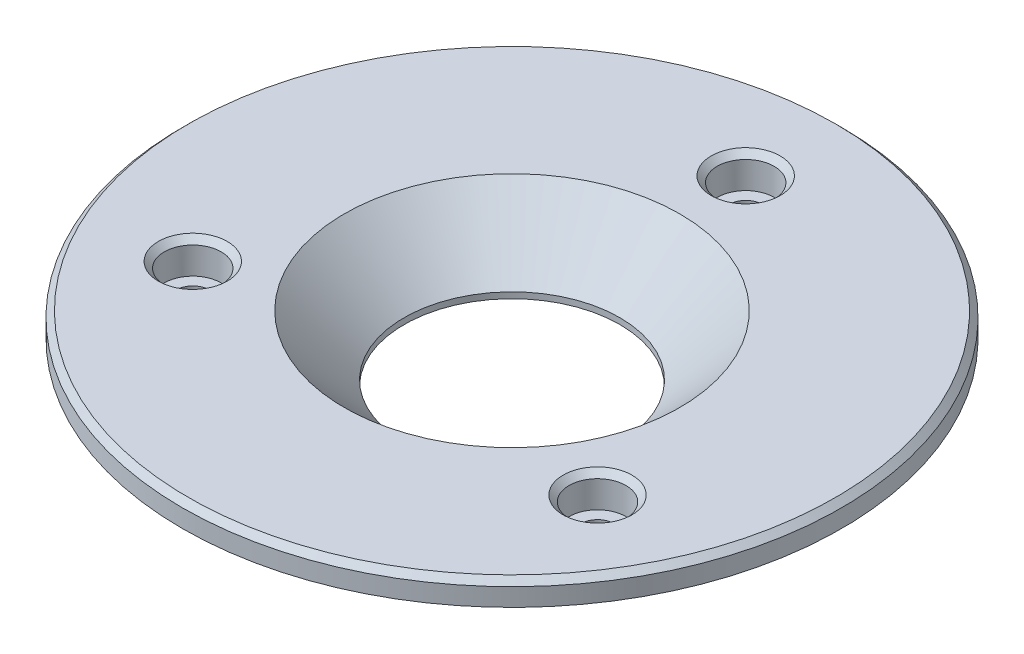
ISO-10303-21;
HEADER;
FILE_DESCRIPTION(('STEP AP214'),'2;1');
FILE_NAME('part.step','',(''),(''),'','','');
FILE_SCHEMA(('AUTOMOTIVE_DESIGN { 1 0 10303 214 1 1 1 1 }'));
ENDSEC;
DATA;
#1=APPLICATION_CONTEXT('core data for automotive mechanical design processes');
#2=APPLICATION_PROTOCOL_DEFINITION('international standard','automotive_design',2000,#1);
#3=PRODUCT_CONTEXT('',#1,'mechanical');
#4=PRODUCT('Part','Part','',(#3));
#5=PRODUCT_RELATED_PRODUCT_CATEGORY('part','',(#4));
#6=PRODUCT_DEFINITION_FORMATION('','',#4);
#7=PRODUCT_DEFINITION_CONTEXT('part definition',#1,'design');
#8=PRODUCT_DEFINITION('design','',#6,#7);
#9=PRODUCT_DEFINITION_SHAPE('','',#8);
#10=(LENGTH_UNIT() NAMED_UNIT(*) SI_UNIT(.MILLI.,.METRE.));
#11=(NAMED_UNIT(*) PLANE_ANGLE_UNIT() SI_UNIT($,.RADIAN.));
#12=(NAMED_UNIT(*) SI_UNIT($,.STERADIAN.) SOLID_ANGLE_UNIT());
#13=UNCERTAINTY_MEASURE_WITH_UNIT(LENGTH_MEASURE(1.E-05),#10,'distance_accuracy_value','');
#14=(GEOMETRIC_REPRESENTATION_CONTEXT(3) GLOBAL_UNCERTAINTY_ASSIGNED_CONTEXT((#13)) GLOBAL_UNIT_ASSIGNED_CONTEXT((#10,
#11,#12)) REPRESENTATION_CONTEXT('',''));
#15=CARTESIAN_POINT('',(0.,0.,0.));
#16=DIRECTION('',(0.,0.,1.));
#17=DIRECTION('',(1.,0.,0.));
#18=AXIS2_PLACEMENT_3D('',#15,#16,#17);
#19=CARTESIAN_POINT('',(-28.,11.,0.));
#20=DIRECTION('',(0.,-1.,0.));
#21=DIRECTION('',(0.,0.,-1.));
#22=AXIS2_PLACEMENT_3D('',#19,#20,#21);
#23=PLANE('',#22);
#24=CARTESIAN_POINT('',(33.7749907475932,11.,19.5));
#25=DIRECTION('',(0.,-1.,0.));
#26=DIRECTION('',(0.,0.,-1.));
#27=AXIS2_PLACEMENT_3D('',#24,#25,#26);
#28=CIRCLE('',#27,5.75);
#29=CARTESIAN_POINT('',(33.7749907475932,11.,13.75));
#30=VERTEX_POINT('',#29);
#31=EDGE_CURVE('E25',#30,#30,#28,.T.);
#32=ORIENTED_EDGE('',*,*,#31,.T.);
#33=EDGE_LOOP('',(#32));
#34=FACE_BOUND('',#33,.T.);
#35=CARTESIAN_POINT('',(0.,11.,-39.));
#36=DIRECTION('',(0.,-1.,0.));
#37=DIRECTION('',(0.,0.,-1.));
#38=AXIS2_PLACEMENT_3D('',#35,#36,#37);
#39=CIRCLE('',#38,5.75);
#40=CARTESIAN_POINT('',(0.,11.,-44.75));
#41=VERTEX_POINT('',#40);
#42=EDGE_CURVE('E29',#41,#41,#39,.T.);
#43=ORIENTED_EDGE('',*,*,#42,.T.);
#44=EDGE_LOOP('',(#43));
#45=FACE_BOUND('',#44,.T.);
#46=CARTESIAN_POINT('',(-33.7749907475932,11.,19.5));
#47=DIRECTION('',(0.,-1.,0.));
#48=DIRECTION('',(0.,0.,-1.));
#49=AXIS2_PLACEMENT_3D('',#46,#47,#48);
#50=CIRCLE('',#49,5.75);
#51=CARTESIAN_POINT('',(-33.7749907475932,11.,13.75));
#52=VERTEX_POINT('',#51);
#53=EDGE_CURVE('E34',#52,#52,#50,.T.);
#54=ORIENTED_EDGE('',*,*,#53,.T.);
#55=EDGE_LOOP('',(#54));
#56=FACE_BOUND('',#55,.T.);
#57=CARTESIAN_POINT('',(0.,11.,0.));
#58=DIRECTION('',(0.,-1.,0.));
#59=DIRECTION('',(0.,0.,-1.));
#60=AXIS2_PLACEMENT_3D('',#57,#58,#59);
#61=CIRCLE('',#60,54.);
#62=CARTESIAN_POINT('',(0.,11.,-54.));
#63=VERTEX_POINT('',#62);
#64=EDGE_CURVE('E58',#63,#63,#61,.F.);
#65=ORIENTED_EDGE('',*,*,#64,.T.);
#66=EDGE_LOOP('',(#65));
#67=FACE_BOUND('',#66,.T.);
#68=CARTESIAN_POINT('',(0.,11.,0.));
#69=DIRECTION('',(0.,-1.,0.));
#70=DIRECTION('',(0.,0.,-1.));
#71=AXIS2_PLACEMENT_3D('',#68,#69,#70);
#72=CIRCLE('',#71,28.);
#73=CARTESIAN_POINT('',(0.,11.,-28.));
#74=VERTEX_POINT('',#73);
#75=EDGE_CURVE('E70',#74,#74,#72,.T.);
#76=ORIENTED_EDGE('',*,*,#75,.T.);
#77=EDGE_LOOP('',(#76));
#78=FACE_BOUND('',#77,.T.);
#79=ADVANCED_FACE('F14',(#34,#45,#56,#67,#78),#23,.F.);
#80=CARTESIAN_POINT('',(0.,1.,0.));
#81=DIRECTION('',(0.,1.,0.));
#82=DIRECTION('',(0.,0.,1.));
#83=AXIS2_PLACEMENT_3D('',#80,#81,#82);
#84=CONICAL_SURFACE('',#83,18.,0.78539816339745);
#85=ORIENTED_EDGE('',*,*,#75,.F.);
#86=EDGE_LOOP('',(#85));
#87=FACE_BOUND('',#86,.T.);
#88=CARTESIAN_POINT('',(0.,1.,0.));
#89=DIRECTION('',(0.,-1.,0.));
#90=DIRECTION('',(0.,0.,-1.));
#91=AXIS2_PLACEMENT_3D('',#88,#89,#90);
#92=CIRCLE('',#91,18.);
#93=CARTESIAN_POINT('',(0.,1.,-18.));
#94=VERTEX_POINT('',#93);
#95=EDGE_CURVE('E83',#94,#94,#92,.T.);
#96=ORIENTED_EDGE('',*,*,#95,.T.);
#97=EDGE_LOOP('',(#96));
#98=FACE_BOUND('',#97,.T.);
#99=ADVANCED_FACE('F123',(#87,#98),#84,.F.);
#100=CARTESIAN_POINT('',(0.,0.,0.));
#101=DIRECTION('',(0.,-1.,0.));
#102=DIRECTION('',(0.,0.,-1.));
#103=AXIS2_PLACEMENT_3D('',#100,#101,#102);
#104=CYLINDRICAL_SURFACE('',#103,18.);
#105=ORIENTED_EDGE('',*,*,#95,.F.);
#106=EDGE_LOOP('',(#105));
#107=FACE_BOUND('',#106,.T.);
#108=CARTESIAN_POINT('',(0.,0.,0.));
#109=DIRECTION('',(0.,-1.,0.));
#110=DIRECTION('',(0.,0.,-1.));
#111=AXIS2_PLACEMENT_3D('',#108,#109,#110);
#112=CIRCLE('',#111,18.);
#113=CARTESIAN_POINT('',(0.,0.,-18.));
#114=VERTEX_POINT('',#113);
#115=EDGE_CURVE('E86',#114,#114,#112,.T.);
#116=ORIENTED_EDGE('',*,*,#115,.T.);
#117=EDGE_LOOP('',(#116));
#118=FACE_BOUND('',#117,.T.);
#119=ADVANCED_FACE('F130',(#107,#118),#104,.F.);
#120=CARTESIAN_POINT('',(-18.,0.,0.));
#121=DIRECTION('',(0.,1.,0.));
#122=DIRECTION('',(0.,0.,1.));
#123=AXIS2_PLACEMENT_3D('',#120,#121,#122);
#124=PLANE('',#123);
#125=CARTESIAN_POINT('',(-33.7749907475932,0.,19.5));
#126=DIRECTION('',(0.,1.,0.));
#127=DIRECTION('',(0.,0.,1.));
#128=AXIS2_PLACEMENT_3D('',#125,#126,#127);
#129=CIRCLE('',#128,3.75);
#130=CARTESIAN_POINT('',(-33.7749907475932,0.,23.25));
#131=VERTEX_POINT('',#130);
#132=EDGE_CURVE('E49',#131,#131,#129,.T.);
#133=ORIENTED_EDGE('',*,*,#132,.T.);
#134=EDGE_LOOP('',(#133));
#135=FACE_BOUND('',#134,.T.);
#136=CARTESIAN_POINT('',(33.7749907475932,0.,19.5));
#137=DIRECTION('',(0.,1.,0.));
#138=DIRECTION('',(0.,0.,1.));
#139=AXIS2_PLACEMENT_3D('',#136,#137,#138);
#140=CIRCLE('',#139,3.75);
#141=CARTESIAN_POINT('',(33.7749907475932,0.,23.25));
#142=VERTEX_POINT('',#141);
#143=EDGE_CURVE('E52',#142,#142,#140,.T.);
#144=ORIENTED_EDGE('',*,*,#143,.T.);
#145=EDGE_LOOP('',(#144));
#146=FACE_BOUND('',#145,.T.);
#147=CARTESIAN_POINT('',(0.,0.,-39.));
#148=DIRECTION('',(0.,1.,0.));
#149=DIRECTION('',(0.,0.,1.));
#150=AXIS2_PLACEMENT_3D('',#147,#148,#149);
#151=CIRCLE('',#150,3.75);
#152=CARTESIAN_POINT('',(0.,0.,-35.25));
#153=VERTEX_POINT('',#152);
#154=EDGE_CURVE('E55',#153,#153,#151,.T.);
#155=ORIENTED_EDGE('',*,*,#154,.T.);
#156=EDGE_LOOP('',(#155));
#157=FACE_BOUND('',#156,.T.);
#158=CARTESIAN_POINT('',(0.,0.,0.));
#159=DIRECTION('',(0.,1.,0.));
#160=DIRECTION('',(0.,0.,1.));
#161=AXIS2_PLACEMENT_3D('',#158,#159,#160);
#162=CIRCLE('',#161,44.);
#163=CARTESIAN_POINT('',(0.,0.,44.));
#164=VERTEX_POINT('',#163);
#165=EDGE_CURVE('E67',#164,#164,#162,.F.);
#166=ORIENTED_EDGE('',*,*,#165,.T.);
#167=EDGE_LOOP('',(#166));
#168=FACE_BOUND('',#167,.T.);
#169=ORIENTED_EDGE('',*,*,#115,.F.);
#170=EDGE_LOOP('',(#169));
#171=FACE_BOUND('',#170,.T.);
#172=ADVANCED_FACE('F181',(#135,#146,#157,#168,#171),#124,.F.);
#173=CARTESIAN_POINT('',(0.,0.,0.));
#174=DIRECTION('',(0.,-1.,0.));
#175=DIRECTION('',(0.,0.,-1.));
#176=AXIS2_PLACEMENT_3D('',#173,#174,#175);
#177=CYLINDRICAL_SURFACE('',#176,45.);
#178=CARTESIAN_POINT('',(0.,1.00000000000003,0.));
#179=DIRECTION('',(0.,1.,0.));
#180=DIRECTION('',(0.,0.,1.));
#181=AXIS2_PLACEMENT_3D('',#178,#179,#180);
#182=CIRCLE('',#181,45.);
#183=CARTESIAN_POINT('',(0.,1.00000000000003,45.));
#184=VERTEX_POINT('',#183);
#185=EDGE_CURVE('E64',#184,#184,#182,.T.);
#186=ORIENTED_EDGE('',*,*,#185,.T.);
#187=EDGE_LOOP('',(#186));
#188=FACE_BOUND('',#187,.T.);
#189=CARTESIAN_POINT('',(0.,7.,0.));
#190=DIRECTION('',(0.,-1.,0.));
#191=DIRECTION('',(0.,0.,-1.));
#192=AXIS2_PLACEMENT_3D('',#189,#190,#191);
#193=CIRCLE('',#192,45.);
#194=CARTESIAN_POINT('',(0.,7.,-45.));
#195=VERTEX_POINT('',#194);
#196=EDGE_CURVE('E89',#195,#195,#193,.T.);
#197=ORIENTED_EDGE('',*,*,#196,.T.);
#198=EDGE_LOOP('',(#197));
#199=FACE_BOUND('',#198,.T.);
#200=ADVANCED_FACE('F185',(#188,#199),#177,.T.);
#201=CARTESIAN_POINT('',(-45.,7.,0.));
#202=DIRECTION('',(0.,1.,0.));
#203=DIRECTION('',(0.,0.,1.));
#204=AXIS2_PLACEMENT_3D('',#201,#202,#203);
#205=PLANE('',#204);
#206=ORIENTED_EDGE('',*,*,#196,.F.);
#207=EDGE_LOOP('',(#206));
#208=FACE_BOUND('',#207,.T.);
#209=CARTESIAN_POINT('',(0.,7.,0.));
#210=DIRECTION('',(0.,-1.,0.));
#211=DIRECTION('',(0.,0.,-1.));
#212=AXIS2_PLACEMENT_3D('',#209,#210,#211);
#213=CIRCLE('',#212,55.);
#214=CARTESIAN_POINT('',(0.,7.,-55.));
#215=VERTEX_POINT('',#214);
#216=EDGE_CURVE('E92',#215,#215,#213,.T.);
#217=ORIENTED_EDGE('',*,*,#216,.T.);
#218=EDGE_LOOP('',(#217));
#219=FACE_BOUND('',#218,.T.);
#220=ADVANCED_FACE('F192',(#208,#219),#205,.F.);
#221=CARTESIAN_POINT('',(0.,0.,0.));
#222=DIRECTION('',(0.,-1.,0.));
#223=DIRECTION('',(0.,0.,-1.));
#224=AXIS2_PLACEMENT_3D('',#221,#222,#223);
#225=CYLINDRICAL_SURFACE('',#224,55.);
#226=CARTESIAN_POINT('',(0.,10.,0.));
#227=DIRECTION('',(0.,-1.,0.));
#228=DIRECTION('',(0.,0.,-1.));
#229=AXIS2_PLACEMENT_3D('',#226,#227,#228);
#230=CIRCLE('',#229,55.);
#231=CARTESIAN_POINT('',(0.,10.,-55.));
#232=VERTEX_POINT('',#231);
#233=EDGE_CURVE('E61',#232,#232,#230,.T.);
#234=ORIENTED_EDGE('',*,*,#233,.T.);
#235=EDGE_LOOP('',(#234));
#236=FACE_BOUND('',#235,.T.);
#237=ORIENTED_EDGE('',*,*,#216,.F.);
#238=EDGE_LOOP('',(#237));
#239=FACE_BOUND('',#238,.T.);
#240=ADVANCED_FACE('F199',(#236,#239),#225,.T.);
#241=CARTESIAN_POINT('',(33.7749907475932,5.5,19.5));
#242=DIRECTION('',(0.,1.,0.));
#243=DIRECTION('',(0.,0.,1.));
#244=AXIS2_PLACEMENT_3D('',#241,#242,#243);
#245=CYLINDRICAL_SURFACE('',#244,4.75);
#246=CARTESIAN_POINT('',(33.7749907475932,10.,19.5));
#247=DIRECTION('',(0.,-1.,0.));
#248=DIRECTION('',(0.,0.,-1.));
#249=AXIS2_PLACEMENT_3D('',#246,#247,#248);
#250=CIRCLE('',#249,4.75);
#251=CARTESIAN_POINT('',(33.7749907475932,10.,14.75));
#252=VERTEX_POINT('',#251);
#253=EDGE_CURVE('E37',#252,#252,#250,.F.);
#254=ORIENTED_EDGE('',*,*,#253,.T.);
#255=EDGE_LOOP('',(#254));
#256=FACE_BOUND('',#255,.T.);
#257=CARTESIAN_POINT('',(33.7749907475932,5.5,19.5));
#258=DIRECTION('',(0.,1.,0.));
#259=DIRECTION('',(0.,0.,-1.));
#260=AXIS2_PLACEMENT_3D('',#257,#258,#259);
#261=CIRCLE('',#260,4.75);
#262=CARTESIAN_POINT('',(33.7749907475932,5.5,14.75));
#263=VERTEX_POINT('',#262);
#264=EDGE_CURVE('E74',#263,#263,#261,.T.);
#265=ORIENTED_EDGE('',*,*,#264,.F.);
#266=EDGE_LOOP('',(#265));
#267=FACE_BOUND('',#266,.T.);
#268=ADVANCED_FACE('F203',(#256,#267),#245,.F.);
#269=CARTESIAN_POINT('',(33.7749907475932,5.5,19.5));
#270=DIRECTION('',(0.,-1.,0.));
#271=DIRECTION('',(0.,0.,-1.));
#272=AXIS2_PLACEMENT_3D('',#269,#270,#271);
#273=PLANE('',#272);
#274=CARTESIAN_POINT('',(33.7749907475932,5.5,19.5));
#275=DIRECTION('',(0.,-1.,0.));
#276=DIRECTION('',(0.,0.,-1.));
#277=AXIS2_PLACEMENT_3D('',#274,#275,#276);
#278=CIRCLE('',#277,2.75);
#279=CARTESIAN_POINT('',(33.7749907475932,5.5,16.75));
#280=VERTEX_POINT('',#279);
#281=EDGE_CURVE('E71',#280,#280,#278,.T.);
#282=ORIENTED_EDGE('',*,*,#281,.T.);
#283=EDGE_LOOP('',(#282));
#284=FACE_BOUND('',#283,.T.);
#285=ORIENTED_EDGE('',*,*,#264,.T.);
#286=EDGE_LOOP('',(#285));
#287=FACE_BOUND('',#286,.T.);
#288=ADVANCED_FACE('F207',(#284,#287),#273,.F.);
#289=CARTESIAN_POINT('',(-33.7749907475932,5.5,19.5));
#290=DIRECTION('',(0.,1.,0.));
#291=DIRECTION('',(0.,0.,1.));
#292=AXIS2_PLACEMENT_3D('',#289,#290,#291);
#293=CYLINDRICAL_SURFACE('',#292,4.75);
#294=CARTESIAN_POINT('',(-33.7749907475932,10.,19.5));
#295=DIRECTION('',(0.,-1.,0.));
#296=DIRECTION('',(0.,0.,-1.));
#297=AXIS2_PLACEMENT_3D('',#294,#295,#296);
#298=CIRCLE('',#297,4.75);
#299=CARTESIAN_POINT('',(-33.7749907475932,10.,14.75));
#300=VERTEX_POINT('',#299);
#301=EDGE_CURVE('E9',#300,#300,#298,.F.);
#302=ORIENTED_EDGE('',*,*,#301,.T.);
#303=EDGE_LOOP('',(#302));
#304=FACE_BOUND('',#303,.T.);
#305=CARTESIAN_POINT('',(-33.7749907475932,5.5,19.5));
#306=DIRECTION('',(0.,1.,0.));
#307=DIRECTION('',(0.,0.,1.));
#308=AXIS2_PLACEMENT_3D('',#305,#306,#307);
#309=CIRCLE('',#308,4.75);
#310=CARTESIAN_POINT('',(-33.7749907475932,5.5,24.25));
#311=VERTEX_POINT('',#310);
#312=EDGE_CURVE('E98',#311,#311,#309,.T.);
#313=ORIENTED_EDGE('',*,*,#312,.F.);
#314=EDGE_LOOP('',(#313));
#315=FACE_BOUND('',#314,.T.);
#316=ADVANCED_FACE('F119',(#304,#315),#293,.F.);
#317=CARTESIAN_POINT('',(-33.7749907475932,5.5,19.5));
#318=DIRECTION('',(0.,1.,0.));
#319=DIRECTION('',(0.,0.,1.));
#320=AXIS2_PLACEMENT_3D('',#317,#318,#319);
#321=PLANE('',#320);
#322=CARTESIAN_POINT('',(-33.7749907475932,5.5,19.5));
#323=DIRECTION('',(0.,1.,0.));
#324=DIRECTION('',(0.,0.,1.));
#325=AXIS2_PLACEMENT_3D('',#322,#323,#324);
#326=CIRCLE('',#325,2.75);
#327=CARTESIAN_POINT('',(-33.7749907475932,5.5,22.25));
#328=VERTEX_POINT('',#327);
#329=EDGE_CURVE('E75',#328,#328,#326,.T.);
#330=ORIENTED_EDGE('',*,*,#329,.F.);
#331=EDGE_LOOP('',(#330));
#332=FACE_BOUND('',#331,.T.);
#333=ORIENTED_EDGE('',*,*,#312,.T.);
#334=EDGE_LOOP('',(#333));
#335=FACE_BOUND('',#334,.T.);
#336=ADVANCED_FACE('F108',(#332,#335),#321,.T.);
#337=CARTESIAN_POINT('',(0.,5.5,-39.));
#338=DIRECTION('',(0.,1.,0.));
#339=DIRECTION('',(0.,0.,1.));
#340=AXIS2_PLACEMENT_3D('',#337,#338,#339);
#341=CYLINDRICAL_SURFACE('',#340,4.75);
#342=CARTESIAN_POINT('',(0.,10.,-39.));
#343=DIRECTION('',(0.,-1.,0.));
#344=DIRECTION('',(0.,0.,-1.));
#345=AXIS2_PLACEMENT_3D('',#342,#343,#344);
#346=CIRCLE('',#345,4.75);
#347=CARTESIAN_POINT('',(0.,10.,-43.75));
#348=VERTEX_POINT('',#347);
#349=EDGE_CURVE('E21',#348,#348,#346,.F.);
#350=ORIENTED_EDGE('',*,*,#349,.T.);
#351=EDGE_LOOP('',(#350));
#352=FACE_BOUND('',#351,.T.);
#353=CARTESIAN_POINT('',(0.,5.5,-39.));
#354=DIRECTION('',(0.,1.,0.));
#355=DIRECTION('',(0.,0.,1.));
#356=AXIS2_PLACEMENT_3D('',#353,#354,#355);
#357=CIRCLE('',#356,4.75);
#358=CARTESIAN_POINT('',(0.,5.5,-34.25));
#359=VERTEX_POINT('',#358);
#360=EDGE_CURVE('E95',#359,#359,#357,.T.);
#361=ORIENTED_EDGE('',*,*,#360,.F.);
#362=EDGE_LOOP('',(#361));
#363=FACE_BOUND('',#362,.T.);
#364=ADVANCED_FACE('F106',(#352,#363),#341,.F.);
#365=CARTESIAN_POINT('',(0.,5.5,-39.));
#366=DIRECTION('',(0.,1.,0.));
#367=DIRECTION('',(0.,0.,1.));
#368=AXIS2_PLACEMENT_3D('',#365,#366,#367);
#369=PLANE('',#368);
#370=CARTESIAN_POINT('',(0.,5.5,-39.));
#371=DIRECTION('',(0.,1.,0.));
#372=DIRECTION('',(0.,0.,1.));
#373=AXIS2_PLACEMENT_3D('',#370,#371,#372);
#374=CIRCLE('',#373,2.75);
#375=CARTESIAN_POINT('',(0.,5.5,-36.25));
#376=VERTEX_POINT('',#375);
#377=EDGE_CURVE('E78',#376,#376,#374,.T.);
#378=ORIENTED_EDGE('',*,*,#377,.F.);
#379=EDGE_LOOP('',(#378));
#380=FACE_BOUND('',#379,.T.);
#381=ORIENTED_EDGE('',*,*,#360,.T.);
#382=EDGE_LOOP('',(#381));
#383=FACE_BOUND('',#382,.T.);
#384=ADVANCED_FACE('F104',(#380,#383),#369,.T.);
#385=CARTESIAN_POINT('',(0.,0.,-39.));
#386=DIRECTION('',(0.,1.,0.));
#387=DIRECTION('',(0.,0.,1.));
#388=AXIS2_PLACEMENT_3D('',#385,#386,#387);
#389=CYLINDRICAL_SURFACE('',#388,2.75);
#390=CARTESIAN_POINT('',(0.,1.00000000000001,-39.));
#391=DIRECTION('',(0.,1.,0.));
#392=DIRECTION('',(0.,0.,1.));
#393=AXIS2_PLACEMENT_3D('',#390,#391,#392);
#394=CIRCLE('',#393,2.75);
#395=CARTESIAN_POINT('',(0.,1.00000000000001,-36.25));
#396=VERTEX_POINT('',#395);
#397=EDGE_CURVE('E40',#396,#396,#394,.F.);
#398=ORIENTED_EDGE('',*,*,#397,.T.);
#399=EDGE_LOOP('',(#398));
#400=FACE_BOUND('',#399,.T.);
#401=ORIENTED_EDGE('',*,*,#377,.T.);
#402=EDGE_LOOP('',(#401));
#403=FACE_BOUND('',#402,.T.);
#404=ADVANCED_FACE('F116',(#400,#403),#389,.F.);
#405=CARTESIAN_POINT('',(-33.7749907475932,0.,19.5));
#406=DIRECTION('',(0.,1.,0.));
#407=DIRECTION('',(0.,0.,1.));
#408=AXIS2_PLACEMENT_3D('',#405,#406,#407);
#409=CYLINDRICAL_SURFACE('',#408,2.75);
#410=CARTESIAN_POINT('',(-33.7749907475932,1.,19.5));
#411=DIRECTION('',(0.,1.,0.));
#412=DIRECTION('',(0.,0.,1.));
#413=AXIS2_PLACEMENT_3D('',#410,#411,#412);
#414=CIRCLE('',#413,2.75);
#415=CARTESIAN_POINT('',(-33.7749907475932,1.,22.25));
#416=VERTEX_POINT('',#415);
#417=EDGE_CURVE('E46',#416,#416,#414,.F.);
#418=ORIENTED_EDGE('',*,*,#417,.T.);
#419=EDGE_LOOP('',(#418));
#420=FACE_BOUND('',#419,.T.);
#421=ORIENTED_EDGE('',*,*,#329,.T.);
#422=EDGE_LOOP('',(#421));
#423=FACE_BOUND('',#422,.T.);
#424=ADVANCED_FACE('F338',(#420,#423),#409,.F.);
#425=CARTESIAN_POINT('',(33.7749907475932,0.,19.5));
#426=DIRECTION('',(0.,1.,0.));
#427=DIRECTION('',(0.,0.,1.));
#428=AXIS2_PLACEMENT_3D('',#425,#426,#427);
#429=CYLINDRICAL_SURFACE('',#428,2.75);
#430=CARTESIAN_POINT('',(33.7749907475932,1.,19.5));
#431=DIRECTION('',(0.,1.,0.));
#432=DIRECTION('',(0.,0.,1.));
#433=AXIS2_PLACEMENT_3D('',#430,#431,#432);
#434=CIRCLE('',#433,2.75);
#435=CARTESIAN_POINT('',(33.7749907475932,1.,22.25));
#436=VERTEX_POINT('',#435);
#437=EDGE_CURVE('E43',#436,#436,#434,.F.);
#438=ORIENTED_EDGE('',*,*,#437,.T.);
#439=EDGE_LOOP('',(#438));
#440=FACE_BOUND('',#439,.T.);
#441=ORIENTED_EDGE('',*,*,#281,.F.);
#442=EDGE_LOOP('',(#441));
#443=FACE_BOUND('',#442,.T.);
#444=ADVANCED_FACE('F140',(#440,#443),#429,.F.);
#445=CARTESIAN_POINT('',(0.,0.,0.));
#446=DIRECTION('',(0.,1.,0.));
#447=DIRECTION('',(0.,0.,1.));
#448=AXIS2_PLACEMENT_3D('',#445,#446,#447);
#449=CONICAL_SURFACE('',#448,44.,0.785398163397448);
#450=ORIENTED_EDGE('',*,*,#185,.F.);
#451=EDGE_LOOP('',(#450));
#452=FACE_BOUND('',#451,.T.);
#453=ORIENTED_EDGE('',*,*,#165,.F.);
#454=EDGE_LOOP('',(#453));
#455=FACE_BOUND('',#454,.T.);
#456=ADVANCED_FACE('F136',(#452,#455),#449,.T.);
#457=CARTESIAN_POINT('',(0.,10.,0.));
#458=DIRECTION('',(0.,-1.,0.));
#459=DIRECTION('',(0.,0.,-1.));
#460=AXIS2_PLACEMENT_3D('',#457,#458,#459);
#461=CONICAL_SURFACE('',#460,55.,0.785398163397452);
#462=ORIENTED_EDGE('',*,*,#64,.F.);
#463=EDGE_LOOP('',(#462));
#464=FACE_BOUND('',#463,.T.);
#465=ORIENTED_EDGE('',*,*,#233,.F.);
#466=EDGE_LOOP('',(#465));
#467=FACE_BOUND('',#466,.T.);
#468=ADVANCED_FACE('F139',(#464,#467),#461,.T.);
#469=CARTESIAN_POINT('',(-33.7749907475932,0.,19.5));
#470=DIRECTION('',(0.,-1.,0.));
#471=DIRECTION('',(0.,0.,-1.));
#472=AXIS2_PLACEMENT_3D('',#469,#470,#471);
#473=CONICAL_SURFACE('',#472,3.75,0.785398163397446);
#474=ORIENTED_EDGE('',*,*,#417,.F.);
#475=EDGE_LOOP('',(#474));
#476=FACE_BOUND('',#475,.T.);
#477=ORIENTED_EDGE('',*,*,#132,.F.);
#478=EDGE_LOOP('',(#477));
#479=FACE_BOUND('',#478,.T.);
#480=ADVANCED_FACE('F144',(#476,#479),#473,.F.);
#481=CARTESIAN_POINT('',(33.7749907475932,0.,19.5));
#482=DIRECTION('',(0.,-1.,0.));
#483=DIRECTION('',(0.,0.,-1.));
#484=AXIS2_PLACEMENT_3D('',#481,#482,#483);
#485=CONICAL_SURFACE('',#484,3.75,0.785398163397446);
#486=ORIENTED_EDGE('',*,*,#437,.F.);
#487=EDGE_LOOP('',(#486));
#488=FACE_BOUND('',#487,.T.);
#489=ORIENTED_EDGE('',*,*,#143,.F.);
#490=EDGE_LOOP('',(#489));
#491=FACE_BOUND('',#490,.T.);
#492=ADVANCED_FACE('F148',(#488,#491),#485,.F.);
#493=CARTESIAN_POINT('',(0.,0.,-39.));
#494=DIRECTION('',(0.,-1.,0.));
#495=DIRECTION('',(0.,0.,-1.));
#496=AXIS2_PLACEMENT_3D('',#493,#494,#495);
#497=CONICAL_SURFACE('',#496,3.75,0.785398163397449);
#498=ORIENTED_EDGE('',*,*,#397,.F.);
#499=EDGE_LOOP('',(#498));
#500=FACE_BOUND('',#499,.T.);
#501=ORIENTED_EDGE('',*,*,#154,.F.);
#502=EDGE_LOOP('',(#501));
#503=FACE_BOUND('',#502,.T.);
#504=ADVANCED_FACE('F152',(#500,#503),#497,.F.);
#505=CARTESIAN_POINT('',(33.7749907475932,10.,19.5));
#506=DIRECTION('',(0.,1.,0.));
#507=DIRECTION('',(0.,0.,1.));
#508=AXIS2_PLACEMENT_3D('',#505,#506,#507);
#509=CONICAL_SURFACE('',#508,4.75,0.785398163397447);
#510=ORIENTED_EDGE('',*,*,#31,.F.);
#511=EDGE_LOOP('',(#510));
#512=FACE_BOUND('',#511,.T.);
#513=ORIENTED_EDGE('',*,*,#253,.F.);
#514=EDGE_LOOP('',(#513));
#515=FACE_BOUND('',#514,.T.);
#516=ADVANCED_FACE('F156',(#512,#515),#509,.F.);
#517=CARTESIAN_POINT('',(0.,10.,-39.));
#518=DIRECTION('',(0.,1.,0.));
#519=DIRECTION('',(0.,0.,1.));
#520=AXIS2_PLACEMENT_3D('',#517,#518,#519);
#521=CONICAL_SURFACE('',#520,4.75,0.785398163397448);
#522=ORIENTED_EDGE('',*,*,#42,.F.);
#523=EDGE_LOOP('',(#522));
#524=FACE_BOUND('',#523,.T.);
#525=ORIENTED_EDGE('',*,*,#349,.F.);
#526=EDGE_LOOP('',(#525));
#527=FACE_BOUND('',#526,.T.);
#528=ADVANCED_FACE('F159',(#524,#527),#521,.F.);
#529=CARTESIAN_POINT('',(-33.7749907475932,10.,19.5));
#530=DIRECTION('',(0.,1.,0.));
#531=DIRECTION('',(0.,0.,1.));
#532=AXIS2_PLACEMENT_3D('',#529,#530,#531);
#533=CONICAL_SURFACE('',#532,4.75,0.785398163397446);
#534=ORIENTED_EDGE('',*,*,#53,.F.);
#535=EDGE_LOOP('',(#534));
#536=FACE_BOUND('',#535,.T.);
#537=ORIENTED_EDGE('',*,*,#301,.F.);
#538=EDGE_LOOP('',(#537));
#539=FACE_BOUND('',#538,.T.);
#540=ADVANCED_FACE('F16',(#536,#539),#533,.F.);
#541=CLOSED_SHELL('',(#79,#99,#119,#172,#200,#220,#240,#268,#288,#316,#336,#364,#384,#404,#424,
#444,#456,#468,#480,#492,#504,#516,#528,#540));
#542=MANIFOLD_SOLID_BREP('B1',#541);
#543=ADVANCED_BREP_SHAPE_REPRESENTATION('',(#18,#542),#14);
#544=SHAPE_DEFINITION_REPRESENTATION(#9,#543);
ENDSEC;
END-ISO-10303-21;
